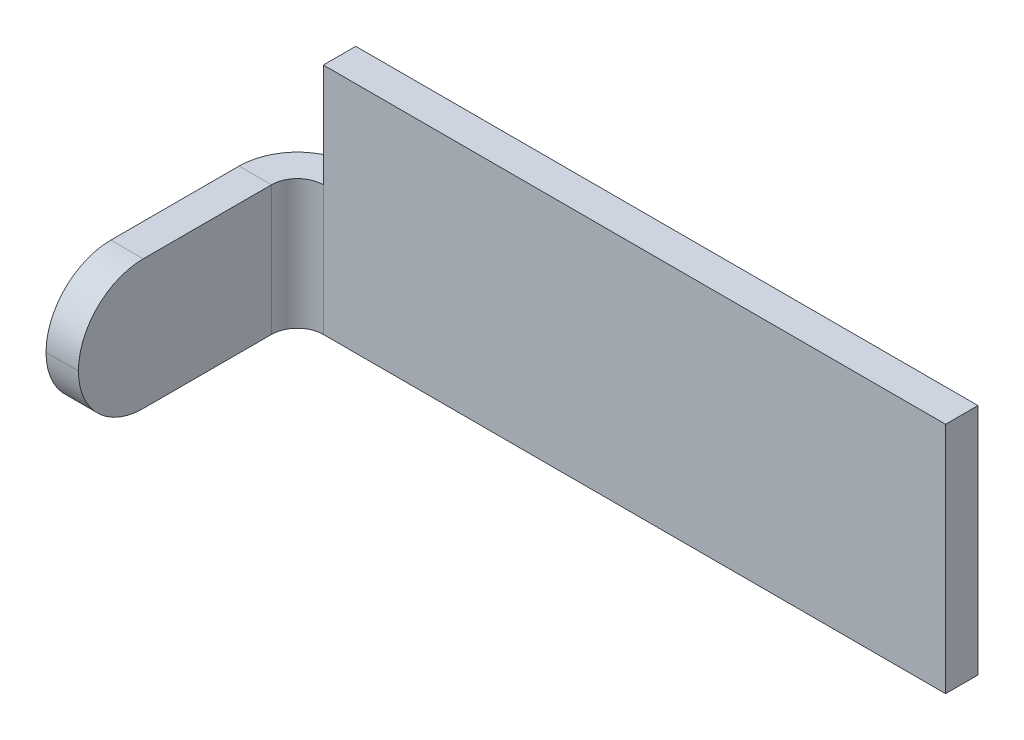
ISO-10303-21;
HEADER;
FILE_DESCRIPTION(('STEP AP214'),'2;1');
FILE_NAME('part.step','',(''),(''),'','','');
FILE_SCHEMA(('AUTOMOTIVE_DESIGN { 1 0 10303 214 1 1 1 1 }'));
ENDSEC;
DATA;
#1=APPLICATION_CONTEXT('core data for automotive mechanical design processes');
#2=APPLICATION_PROTOCOL_DEFINITION('international standard','automotive_design',2000,#1);
#3=PRODUCT_CONTEXT('',#1,'mechanical');
#4=PRODUCT('Part','Part','',(#3));
#5=PRODUCT_RELATED_PRODUCT_CATEGORY('part','',(#4));
#6=PRODUCT_DEFINITION_FORMATION('','',#4);
#7=PRODUCT_DEFINITION_CONTEXT('part definition',#1,'design');
#8=PRODUCT_DEFINITION('design','',#6,#7);
#9=PRODUCT_DEFINITION_SHAPE('','',#8);
#10=(LENGTH_UNIT() NAMED_UNIT(*) SI_UNIT(.MILLI.,.METRE.));
#11=(NAMED_UNIT(*) PLANE_ANGLE_UNIT() SI_UNIT($,.RADIAN.));
#12=(NAMED_UNIT(*) SI_UNIT($,.STERADIAN.) SOLID_ANGLE_UNIT());
#13=UNCERTAINTY_MEASURE_WITH_UNIT(LENGTH_MEASURE(1.E-05),#10,'distance_accuracy_value','');
#14=(GEOMETRIC_REPRESENTATION_CONTEXT(3) GLOBAL_UNCERTAINTY_ASSIGNED_CONTEXT((#13)) GLOBAL_UNIT_ASSIGNED_CONTEXT((#10,
#11,#12)) REPRESENTATION_CONTEXT('',''));
#15=CARTESIAN_POINT('',(0.,0.,0.));
#16=DIRECTION('',(0.,0.,1.));
#17=DIRECTION('',(1.,0.,0.));
#18=AXIS2_PLACEMENT_3D('',#15,#16,#17);
#19=CARTESIAN_POINT('',(-0.449999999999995,0.999999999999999,1.68949119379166));
#20=DIRECTION('',(0.,1.,0.));
#21=DIRECTION('',(1.,0.,0.));
#22=AXIS2_PLACEMENT_3D('',#19,#20,#21);
#23=PLANE('',#22);
#24=DIRECTION('',(0.,0.,1.));
#25=VECTOR('',#24,1.);
#26=CARTESIAN_POINT('',(-0.199999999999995,0.999999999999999,1.68949119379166));
#27=LINE('',#26,#25);
#28=CARTESIAN_POINT('',(-0.2,0.999999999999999,0.200000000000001));
#29=VERTEX_POINT('',#28);
#30=CARTESIAN_POINT('',(-0.199999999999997,0.999999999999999,1.18949119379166));
#31=VERTEX_POINT('',#30);
#32=EDGE_CURVE('E72',#29,#31,#27,.T.);
#33=ORIENTED_EDGE('',*,*,#32,.F.);
#34=DIRECTION('',(-1.,0.,0.));
#35=VECTOR('',#34,1.);
#36=CARTESIAN_POINT('',(-0.45,0.999999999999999,0.200000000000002));
#37=LINE('',#36,#35);
#38=CARTESIAN_POINT('',(-0.45,0.999999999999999,0.200000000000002));
#39=VERTEX_POINT('',#38);
#40=EDGE_CURVE('E205',#29,#39,#37,.T.);
#41=ORIENTED_EDGE('',*,*,#40,.T.);
#42=DIRECTION('',(0.,0.,1.));
#43=VECTOR('',#42,1.);
#44=CARTESIAN_POINT('',(-0.449999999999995,0.999999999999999,1.68949119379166));
#45=LINE('',#44,#43);
#46=CARTESIAN_POINT('',(-0.449999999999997,0.999999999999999,1.18949119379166));
#47=VERTEX_POINT('',#46);
#48=EDGE_CURVE('E51',#39,#47,#45,.T.);
#49=ORIENTED_EDGE('',*,*,#48,.T.);
#50=DIRECTION('',(1.,0.,0.));
#51=VECTOR('',#50,1.);
#52=CARTESIAN_POINT('',(-0.449999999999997,0.999999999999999,1.18949119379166));
#53=LINE('',#52,#51);
#54=EDGE_CURVE('E195',#47,#31,#53,.T.);
#55=ORIENTED_EDGE('',*,*,#54,.T.);
#56=EDGE_LOOP('',(#33,#41,#49,#55));
#57=FACE_BOUND('',#56,.T.);
#58=ADVANCED_FACE('F47',(#57),#23,.T.);
#59=CARTESIAN_POINT('',(-0.450000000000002,0.,-0.310508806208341));
#60=DIRECTION('',(0.,-1.,0.));
#61=DIRECTION('',(0.,0.,-1.));
#62=AXIS2_PLACEMENT_3D('',#59,#60,#61);
#63=PLANE('',#62);
#64=DIRECTION('',(0.,0.,-1.));
#65=VECTOR('',#64,1.);
#66=CARTESIAN_POINT('',(-0.450000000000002,0.,-0.310508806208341));
#67=LINE('',#66,#65);
#68=CARTESIAN_POINT('',(-0.449999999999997,0.,1.18949119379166));
#69=VERTEX_POINT('',#68);
#70=CARTESIAN_POINT('',(-0.45,0.,0.200000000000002));
#71=VERTEX_POINT('',#70);
#72=EDGE_CURVE('E210',#69,#71,#67,.T.);
#73=ORIENTED_EDGE('',*,*,#72,.T.);
#74=DIRECTION('',(1.,0.,0.));
#75=VECTOR('',#74,1.);
#76=CARTESIAN_POINT('',(-0.45,0.,0.200000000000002));
#77=LINE('',#76,#75);
#78=CARTESIAN_POINT('',(-0.2,0.,0.200000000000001));
#79=VERTEX_POINT('',#78);
#80=EDGE_CURVE('E12',#71,#79,#77,.T.);
#81=ORIENTED_EDGE('',*,*,#80,.T.);
#82=DIRECTION('',(0.,0.,-1.));
#83=VECTOR('',#82,1.);
#84=CARTESIAN_POINT('',(-0.200000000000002,0.,-0.310508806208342));
#85=LINE('',#84,#83);
#86=CARTESIAN_POINT('',(-0.199999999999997,0.,1.18949119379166));
#87=VERTEX_POINT('',#86);
#88=EDGE_CURVE('E65',#87,#79,#85,.T.);
#89=ORIENTED_EDGE('',*,*,#88,.F.);
#90=DIRECTION('',(1.,0.,0.));
#91=VECTOR('',#90,1.);
#92=CARTESIAN_POINT('',(-0.449999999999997,0.,1.18949119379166));
#93=LINE('',#92,#91);
#94=EDGE_CURVE('E184',#87,#69,#93,.F.);
#95=ORIENTED_EDGE('',*,*,#94,.T.);
#96=EDGE_LOOP('',(#73,#81,#89,#95));
#97=FACE_BOUND('',#96,.T.);
#98=ADVANCED_FACE('F49',(#97),#63,.T.);
#99=CARTESIAN_POINT('',(-0.200000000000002,0.,-0.310508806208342));
#100=DIRECTION('',(1.,0.,0.));
#101=DIRECTION('',(0.,0.,-1.));
#102=AXIS2_PLACEMENT_3D('',#99,#100,#101);
#103=PLANE('',#102);
#104=ORIENTED_EDGE('',*,*,#88,.T.);
#105=DIRECTION('',(0.,1.,0.));
#106=VECTOR('',#105,1.);
#107=CARTESIAN_POINT('',(-0.2,0.,0.200000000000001));
#108=LINE('',#107,#106);
#109=EDGE_CURVE('E57',#79,#29,#108,.T.);
#110=ORIENTED_EDGE('',*,*,#109,.T.);
#111=ORIENTED_EDGE('',*,*,#32,.T.);
#112=CARTESIAN_POINT('',(-0.199999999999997,0.499999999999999,1.18949119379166));
#113=DIRECTION('',(1.,0.,0.));
#114=DIRECTION('',(0.,0.,-1.));
#115=AXIS2_PLACEMENT_3D('',#112,#113,#114);
#116=CIRCLE('',#115,0.5);
#117=CARTESIAN_POINT('',(-0.199999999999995,0.499999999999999,1.68949119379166));
#118=VERTEX_POINT('',#117);
#119=EDGE_CURVE('E178',#31,#118,#116,.T.);
#120=ORIENTED_EDGE('',*,*,#119,.T.);
#121=CARTESIAN_POINT('',(-0.199999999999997,0.5,1.18949119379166));
#122=DIRECTION('',(1.,0.,0.));
#123=DIRECTION('',(0.,0.,-1.));
#124=AXIS2_PLACEMENT_3D('',#121,#122,#123);
#125=CIRCLE('',#124,0.5);
#126=EDGE_CURVE('E181',#118,#87,#125,.T.);
#127=ORIENTED_EDGE('',*,*,#126,.T.);
#128=EDGE_LOOP('',(#104,#110,#111,#120,#127));
#129=FACE_BOUND('',#128,.T.);
#130=ADVANCED_FACE('F288',(#129),#103,.T.);
#131=CARTESIAN_POINT('',(-0.450000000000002,0.,-0.310508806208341));
#132=DIRECTION('',(1.,0.,0.));
#133=DIRECTION('',(0.,0.,-1.));
#134=AXIS2_PLACEMENT_3D('',#131,#132,#133);
#135=PLANE('',#134);
#136=DIRECTION('',(0.,1.,0.));
#137=VECTOR('',#136,1.);
#138=CARTESIAN_POINT('',(-0.45,0.,0.200000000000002));
#139=LINE('',#138,#137);
#140=EDGE_CURVE('E198',#71,#39,#139,.T.);
#141=ORIENTED_EDGE('',*,*,#140,.F.);
#142=ORIENTED_EDGE('',*,*,#72,.F.);
#143=CARTESIAN_POINT('',(-0.449999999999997,0.5,1.18949119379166));
#144=DIRECTION('',(1.,0.,0.));
#145=DIRECTION('',(0.,0.,-1.));
#146=AXIS2_PLACEMENT_3D('',#143,#144,#145);
#147=CIRCLE('',#146,0.5);
#148=CARTESIAN_POINT('',(-0.449999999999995,0.499999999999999,1.68949119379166));
#149=VERTEX_POINT('',#148);
#150=EDGE_CURVE('E192',#69,#149,#147,.F.);
#151=ORIENTED_EDGE('',*,*,#150,.T.);
#152=CARTESIAN_POINT('',(-0.449999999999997,0.499999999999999,1.18949119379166));
#153=DIRECTION('',(1.,0.,0.));
#154=DIRECTION('',(0.,0.,-1.));
#155=AXIS2_PLACEMENT_3D('',#152,#153,#154);
#156=CIRCLE('',#155,0.5);
#157=EDGE_CURVE('E188',#149,#47,#156,.F.);
#158=ORIENTED_EDGE('',*,*,#157,.T.);
#159=ORIENTED_EDGE('',*,*,#48,.F.);
#160=EDGE_LOOP('',(#141,#142,#151,#158,#159));
#161=FACE_BOUND('',#160,.T.);
#162=ADVANCED_FACE('F291',(#161),#135,.F.);
#163=CARTESIAN_POINT('',(-0.449999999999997,0.499999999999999,1.18949119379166));
#164=DIRECTION('',(1.,0.,0.));
#165=DIRECTION('',(0.,0.,-1.));
#166=AXIS2_PLACEMENT_3D('',#163,#164,#165);
#167=CYLINDRICAL_SURFACE('',#166,0.5);
#168=ORIENTED_EDGE('',*,*,#54,.F.);
#169=ORIENTED_EDGE('',*,*,#157,.F.);
#170=DIRECTION('',(1.,0.,0.));
#171=VECTOR('',#170,1.);
#172=CARTESIAN_POINT('',(-0.449999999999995,0.499999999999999,1.68949119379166));
#173=LINE('',#172,#171);
#174=EDGE_CURVE('E199',#118,#149,#173,.F.);
#175=ORIENTED_EDGE('',*,*,#174,.F.);
#176=ORIENTED_EDGE('',*,*,#119,.F.);
#177=EDGE_LOOP('',(#168,#169,#175,#176));
#178=FACE_BOUND('',#177,.T.);
#179=ADVANCED_FACE('F279',(#178),#167,.T.);
#180=CARTESIAN_POINT('',(-0.449999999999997,0.5,1.18949119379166));
#181=DIRECTION('',(1.,0.,0.));
#182=DIRECTION('',(0.,0.,-1.));
#183=AXIS2_PLACEMENT_3D('',#180,#181,#182);
#184=CYLINDRICAL_SURFACE('',#183,0.5);
#185=ORIENTED_EDGE('',*,*,#150,.F.);
#186=ORIENTED_EDGE('',*,*,#94,.F.);
#187=ORIENTED_EDGE('',*,*,#126,.F.);
#188=ORIENTED_EDGE('',*,*,#174,.T.);
#189=EDGE_LOOP('',(#185,#186,#187,#188));
#190=FACE_BOUND('',#189,.T.);
#191=ADVANCED_FACE('F272',(#190),#184,.T.);
#192=CARTESIAN_POINT('',(4.8,0.,-0.25));
#193=DIRECTION('',(1.,0.,0.));
#194=DIRECTION('',(0.,0.,-1.));
#195=AXIS2_PLACEMENT_3D('',#192,#193,#194);
#196=PLANE('',#195);
#197=DIRECTION('',(0.,1.,0.));
#198=VECTOR('',#197,1.);
#199=CARTESIAN_POINT('',(4.8,0.,0.));
#200=LINE('',#199,#198);
#201=CARTESIAN_POINT('',(4.8,0.,0.));
#202=VERTEX_POINT('',#201);
#203=CARTESIAN_POINT('',(4.8,1.8,0.));
#204=VERTEX_POINT('',#203);
#205=EDGE_CURVE('E226',#202,#204,#200,.T.);
#206=ORIENTED_EDGE('',*,*,#205,.F.);
#207=DIRECTION('',(0.,0.,1.));
#208=VECTOR('',#207,1.);
#209=CARTESIAN_POINT('',(4.8,0.,-0.25));
#210=LINE('',#209,#208);
#211=CARTESIAN_POINT('',(4.8,0.,-0.25));
#212=VERTEX_POINT('',#211);
#213=EDGE_CURVE('E162',#212,#202,#210,.T.);
#214=ORIENTED_EDGE('',*,*,#213,.F.);
#215=DIRECTION('',(0.,1.,0.));
#216=VECTOR('',#215,1.);
#217=CARTESIAN_POINT('',(4.8,0.,-0.25));
#218=LINE('',#217,#216);
#219=CARTESIAN_POINT('',(4.8,1.8,-0.25));
#220=VERTEX_POINT('',#219);
#221=EDGE_CURVE('E157',#212,#220,#218,.T.);
#222=ORIENTED_EDGE('',*,*,#221,.T.);
#223=DIRECTION('',(0.,0.,1.));
#224=VECTOR('',#223,1.);
#225=CARTESIAN_POINT('',(4.8,1.8,-0.25));
#226=LINE('',#225,#224);
#227=EDGE_CURVE('E244',#220,#204,#226,.T.);
#228=ORIENTED_EDGE('',*,*,#227,.T.);
#229=EDGE_LOOP('',(#206,#214,#222,#228));
#230=FACE_BOUND('',#229,.T.);
#231=ADVANCED_FACE('F270',(#230),#196,.T.);
#232=CARTESIAN_POINT('',(0.,1.8,-0.25));
#233=DIRECTION('',(0.,1.,0.));
#234=DIRECTION('',(-1.,0.,0.));
#235=AXIS2_PLACEMENT_3D('',#232,#233,#234);
#236=PLANE('',#235);
#237=DIRECTION('',(-1.,0.,0.));
#238=VECTOR('',#237,1.);
#239=CARTESIAN_POINT('',(0.,1.8,0.));
#240=LINE('',#239,#238);
#241=CARTESIAN_POINT('',(0.,1.8,0.));
#242=VERTEX_POINT('',#241);
#243=EDGE_CURVE('E222',#204,#242,#240,.T.);
#244=ORIENTED_EDGE('',*,*,#243,.F.);
#245=ORIENTED_EDGE('',*,*,#227,.F.);
#246=DIRECTION('',(-1.,0.,0.));
#247=VECTOR('',#246,1.);
#248=CARTESIAN_POINT('',(0.,1.8,-0.25));
#249=LINE('',#248,#247);
#250=CARTESIAN_POINT('',(0.,1.8,-0.25));
#251=VERTEX_POINT('',#250);
#252=EDGE_CURVE('E240',#220,#251,#249,.T.);
#253=ORIENTED_EDGE('',*,*,#252,.T.);
#254=DIRECTION('',(0.,0.,1.));
#255=VECTOR('',#254,1.);
#256=CARTESIAN_POINT('',(0.,1.8,-0.25));
#257=LINE('',#256,#255);
#258=EDGE_CURVE('E150',#251,#242,#257,.T.);
#259=ORIENTED_EDGE('',*,*,#258,.T.);
#260=EDGE_LOOP('',(#244,#245,#253,#259));
#261=FACE_BOUND('',#260,.T.);
#262=ADVANCED_FACE('F268',(#261),#236,.T.);
#263=CARTESIAN_POINT('',(0.,0.,-0.25));
#264=DIRECTION('',(0.,0.,1.));
#265=DIRECTION('',(1.,0.,0.));
#266=AXIS2_PLACEMENT_3D('',#263,#264,#265);
#267=PLANE('',#266);
#268=DIRECTION('',(1.,0.,0.));
#269=VECTOR('',#268,1.);
#270=CARTESIAN_POINT('',(0.,0.,-0.25));
#271=LINE('',#270,#269);
#272=CARTESIAN_POINT('',(0.,0.,-0.25));
#273=VERTEX_POINT('',#272);
#274=EDGE_CURVE('E153',#273,#212,#271,.T.);
#275=ORIENTED_EDGE('',*,*,#274,.F.);
#276=DIRECTION('',(0.,1.,0.));
#277=VECTOR('',#276,1.);
#278=CARTESIAN_POINT('',(0.,0.,-0.25));
#279=LINE('',#278,#277);
#280=CARTESIAN_POINT('',(0.,0.999999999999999,-0.25));
#281=VERTEX_POINT('',#280);
#282=EDGE_CURVE('E141',#273,#281,#279,.T.);
#283=ORIENTED_EDGE('',*,*,#282,.T.);
#284=DIRECTION('',(0.,-1.,0.));
#285=VECTOR('',#284,1.);
#286=CARTESIAN_POINT('',(0.,0.999999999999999,-0.25));
#287=LINE('',#286,#285);
#288=EDGE_CURVE('E149',#251,#281,#287,.T.);
#289=ORIENTED_EDGE('',*,*,#288,.F.);
#290=ORIENTED_EDGE('',*,*,#252,.F.);
#291=ORIENTED_EDGE('',*,*,#221,.F.);
#292=EDGE_LOOP('',(#275,#283,#289,#290,#291));
#293=FACE_BOUND('',#292,.T.);
#294=ADVANCED_FACE('F154',(#293),#267,.F.);
#295=CARTESIAN_POINT('',(0.,0.999999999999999,-0.25));
#296=DIRECTION('',(-1.,0.,0.));
#297=DIRECTION('',(0.,0.,1.));
#298=AXIS2_PLACEMENT_3D('',#295,#296,#297);
#299=PLANE('',#298);
#300=DIRECTION('',(0.,-1.,0.));
#301=VECTOR('',#300,1.);
#302=CARTESIAN_POINT('',(0.,0.999999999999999,0.));
#303=LINE('',#302,#301);
#304=CARTESIAN_POINT('',(0.,0.999999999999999,0.));
#305=VERTEX_POINT('',#304);
#306=EDGE_CURVE('E163',#242,#305,#303,.T.);
#307=ORIENTED_EDGE('',*,*,#306,.F.);
#308=ORIENTED_EDGE('',*,*,#258,.F.);
#309=ORIENTED_EDGE('',*,*,#288,.T.);
#310=DIRECTION('',(0.,0.,1.));
#311=VECTOR('',#310,1.);
#312=CARTESIAN_POINT('',(0.,0.999999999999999,-0.25));
#313=LINE('',#312,#311);
#314=EDGE_CURVE('E232',#281,#305,#313,.T.);
#315=ORIENTED_EDGE('',*,*,#314,.T.);
#316=EDGE_LOOP('',(#307,#308,#309,#315));
#317=FACE_BOUND('',#316,.T.);
#318=ADVANCED_FACE('F266',(#317),#299,.T.);
#319=CARTESIAN_POINT('',(0.,0.,0.));
#320=DIRECTION('',(0.,0.,1.));
#321=DIRECTION('',(1.,0.,0.));
#322=AXIS2_PLACEMENT_3D('',#319,#320,#321);
#323=PLANE('',#322);
#324=DIRECTION('',(0.,1.,0.));
#325=VECTOR('',#324,1.);
#326=CARTESIAN_POINT('',(0.,0.,0.));
#327=LINE('',#326,#325);
#328=CARTESIAN_POINT('',(0.,0.,0.));
#329=VERTEX_POINT('',#328);
#330=EDGE_CURVE('E170',#329,#305,#327,.T.);
#331=ORIENTED_EDGE('',*,*,#330,.F.);
#332=DIRECTION('',(1.,0.,0.));
#333=VECTOR('',#332,1.);
#334=CARTESIAN_POINT('',(0.,0.,0.));
#335=LINE('',#334,#333);
#336=EDGE_CURVE('E167',#329,#202,#335,.T.);
#337=ORIENTED_EDGE('',*,*,#336,.T.);
#338=ORIENTED_EDGE('',*,*,#205,.T.);
#339=ORIENTED_EDGE('',*,*,#243,.T.);
#340=ORIENTED_EDGE('',*,*,#306,.T.);
#341=EDGE_LOOP('',(#331,#337,#338,#339,#340));
#342=FACE_BOUND('',#341,.T.);
#343=ADVANCED_FACE('F263',(#342),#323,.T.);
#344=CARTESIAN_POINT('',(0.,0.,-0.25));
#345=DIRECTION('',(0.,-1.,0.));
#346=DIRECTION('',(1.,0.,0.));
#347=AXIS2_PLACEMENT_3D('',#344,#345,#346);
#348=PLANE('',#347);
#349=DIRECTION('',(0.,0.,1.));
#350=VECTOR('',#349,1.);
#351=CARTESIAN_POINT('',(0.,0.,-0.25));
#352=LINE('',#351,#350);
#353=EDGE_CURVE('E131',#273,#329,#352,.T.);
#354=ORIENTED_EDGE('',*,*,#353,.F.);
#355=ORIENTED_EDGE('',*,*,#274,.T.);
#356=ORIENTED_EDGE('',*,*,#213,.T.);
#357=ORIENTED_EDGE('',*,*,#336,.F.);
#358=EDGE_LOOP('',(#354,#355,#356,#357));
#359=FACE_BOUND('',#358,.T.);
#360=ADVANCED_FACE('F166',(#359),#348,.T.);
#361=CARTESIAN_POINT('',(0.,0.,0.2));
#362=DIRECTION('',(0.,-1.,0.));
#363=DIRECTION('',(0.,0.,-1.));
#364=AXIS2_PLACEMENT_3D('',#361,#362,#363);
#365=PLANE('',#364);
#366=ORIENTED_EDGE('',*,*,#353,.T.);
#367=CARTESIAN_POINT('',(0.,0.,0.2));
#368=DIRECTION('',(0.,1.,0.));
#369=DIRECTION('',(0.,0.,1.));
#370=AXIS2_PLACEMENT_3D('',#367,#368,#369);
#371=CIRCLE('',#370,0.2);
#372=EDGE_CURVE('E250',#329,#79,#371,.T.);
#373=ORIENTED_EDGE('',*,*,#372,.T.);
#374=ORIENTED_EDGE('',*,*,#80,.F.);
#375=CARTESIAN_POINT('',(0.,0.,0.2));
#376=DIRECTION('',(0.,1.,0.));
#377=DIRECTION('',(0.,0.,-1.));
#378=AXIS2_PLACEMENT_3D('',#375,#376,#377);
#379=CIRCLE('',#378,0.45);
#380=EDGE_CURVE('E126',#273,#71,#379,.T.);
#381=ORIENTED_EDGE('',*,*,#380,.F.);
#382=EDGE_LOOP('',(#366,#373,#374,#381));
#383=FACE_BOUND('',#382,.T.);
#384=ADVANCED_FACE('F128',(#383),#365,.T.);
#385=CARTESIAN_POINT('',(0.,0.999999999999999,0.2));
#386=DIRECTION('',(0.,1.,0.));
#387=DIRECTION('',(0.,0.,1.));
#388=AXIS2_PLACEMENT_3D('',#385,#386,#387);
#389=PLANE('',#388);
#390=ORIENTED_EDGE('',*,*,#40,.F.);
#391=CARTESIAN_POINT('',(0.,0.999999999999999,0.2));
#392=DIRECTION('',(0.,1.,0.));
#393=DIRECTION('',(0.,0.,1.));
#394=AXIS2_PLACEMENT_3D('',#391,#392,#393);
#395=CIRCLE('',#394,0.2);
#396=EDGE_CURVE('E137',#29,#305,#395,.F.);
#397=ORIENTED_EDGE('',*,*,#396,.T.);
#398=ORIENTED_EDGE('',*,*,#314,.F.);
#399=CARTESIAN_POINT('',(0.,0.999999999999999,0.2));
#400=DIRECTION('',(0.,-1.,0.));
#401=DIRECTION('',(0.,0.,1.));
#402=AXIS2_PLACEMENT_3D('',#399,#400,#401);
#403=CIRCLE('',#402,0.45);
#404=EDGE_CURVE('E136',#39,#281,#403,.T.);
#405=ORIENTED_EDGE('',*,*,#404,.F.);
#406=EDGE_LOOP('',(#390,#397,#398,#405));
#407=FACE_BOUND('',#406,.T.);
#408=ADVANCED_FACE('F258',(#407),#389,.T.);
#409=CARTESIAN_POINT('',(0.,-0.650269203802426,0.2));
#410=DIRECTION('',(0.,1.,0.));
#411=DIRECTION('',(0.,0.,1.));
#412=AXIS2_PLACEMENT_3D('',#409,#410,#411);
#413=CYLINDRICAL_SURFACE('',#412,0.45);
#414=ORIENTED_EDGE('',*,*,#404,.T.);
#415=ORIENTED_EDGE('',*,*,#282,.F.);
#416=ORIENTED_EDGE('',*,*,#380,.T.);
#417=ORIENTED_EDGE('',*,*,#140,.T.);
#418=EDGE_LOOP('',(#414,#415,#416,#417));
#419=FACE_BOUND('',#418,.T.);
#420=ADVANCED_FACE('F143',(#419),#413,.T.);
#421=CARTESIAN_POINT('',(0.,-0.650269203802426,0.2));
#422=DIRECTION('',(0.,1.,0.));
#423=DIRECTION('',(0.,0.,1.));
#424=AXIS2_PLACEMENT_3D('',#421,#422,#423);
#425=CYLINDRICAL_SURFACE('',#424,0.2);
#426=ORIENTED_EDGE('',*,*,#396,.F.);
#427=ORIENTED_EDGE('',*,*,#109,.F.);
#428=ORIENTED_EDGE('',*,*,#372,.F.);
#429=ORIENTED_EDGE('',*,*,#330,.T.);
#430=EDGE_LOOP('',(#426,#427,#428,#429));
#431=FACE_BOUND('',#430,.T.);
#432=ADVANCED_FACE('F310',(#431),#425,.F.);
#433=CLOSED_SHELL('',(#58,#98,#130,#162,#179,#191,#231,#262,#294,#318,#343,#360,#384,#408,#420,#432));
#434=MANIFOLD_SOLID_BREP('B2',#433);
#435=ADVANCED_BREP_SHAPE_REPRESENTATION('',(#18,#434),#14);
#436=SHAPE_DEFINITION_REPRESENTATION(#9,#435);
ENDSEC;
END-ISO-10303-21;
